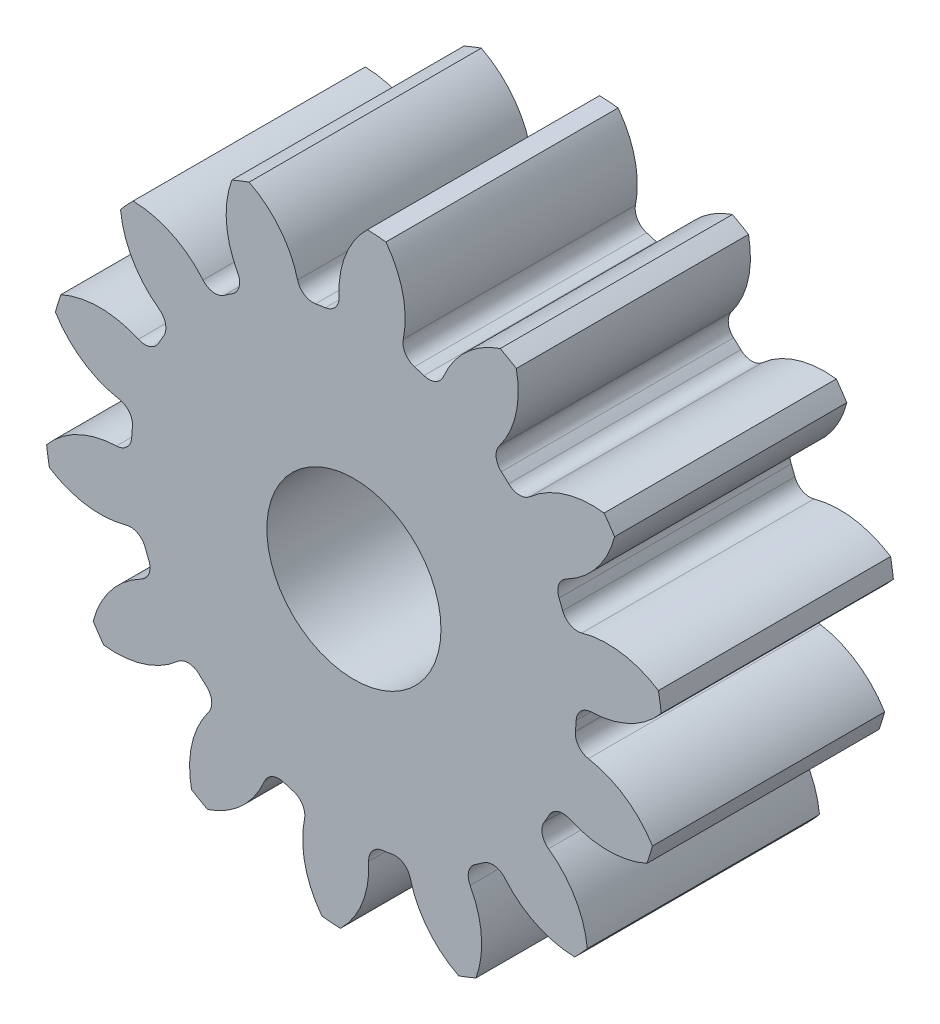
from build123d import *

# Parameters (mm, degrees)
SKETCH3_R         = 135.466666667
GEARBODY_DEPTH    = 101.6
TOOTHCUT_DEPTH    = 217.852474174
CIRPATTERN1_COUNT = 14
BOREDIA_R         = 38.1
BORE_DEPTH        = 12700


with BuildPart() as part:
    # Sketch3 → gearBody (new body)
    with BuildSketch(Plane.XY):
        Circle(SKETCH3_R)
    extrude(amount=GEARBODY_DEPTH)

    # Sketch2 → toothCut (cut, through all)
    with BuildSketch(Plane.XY):
        with BuildLine():
            ThreePointArc((96.919586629, -9.319952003), (97.103474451, -7.154231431), (97.238974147, -4.984945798))
            ThreePointArc((97.238974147, -4.984945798), (99.31198689, -0.40185355), (103.947190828, 1.551861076))
            ThreePointArc((103.947190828, 1.551861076), (121.517616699, 5.995722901), (135.466666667, 17.56688439))
            ThreePointArc((135.466666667, 17.56688439), (136.231680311, -10.037055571), (131.429371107, -37.230815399))
            ThreePointArc((131.429371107, -37.230815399), (119.326777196, -23.740263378), (102.597353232, -16.769313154))
            ThreePointArc((102.597353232, -16.769313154), (98.298530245, -14.157371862), (96.919586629, -9.319952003))
        make_face()
    toothcut = extrude(amount=TOOTHCUT_DEPTH, mode=Mode.SUBTRACT)

    # CirPattern1: toothCut ×14 about axis
    cirpattern1_axis = Axis((0, 0, 0), (0, 0, 1))
    for i in range(1, CIRPATTERN1_COUNT):
        add(toothcut.rotate(cirpattern1_axis, i * 360 / CIRPATTERN1_COUNT), mode=Mode.SUBTRACT)

    # boreDia → bore (cut, symmetric)
    with BuildSketch(Plane.XY):
        Circle(BOREDIA_R)
    extrude(amount=BORE_DEPTH, both=True, mode=Mode.SUBTRACT)


solid = part.part
